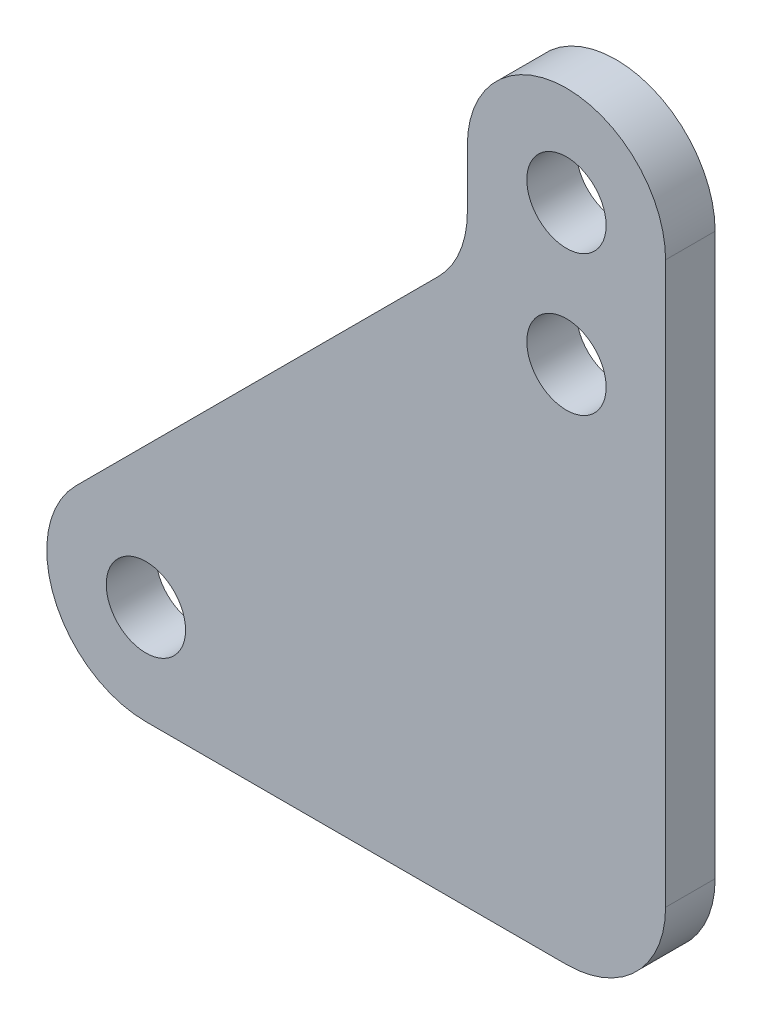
ISO-10303-21;
HEADER;
FILE_DESCRIPTION(('STEP AP214'),'2;1');
FILE_NAME('part.step','',(''),(''),'','','');
FILE_SCHEMA(('AUTOMOTIVE_DESIGN { 1 0 10303 214 1 1 1 1 }'));
ENDSEC;
DATA;
#1=APPLICATION_CONTEXT('core data for automotive mechanical design processes');
#2=APPLICATION_PROTOCOL_DEFINITION('international standard','automotive_design',2000,#1);
#3=PRODUCT_CONTEXT('',#1,'mechanical');
#4=PRODUCT('Part','Part','',(#3));
#5=PRODUCT_RELATED_PRODUCT_CATEGORY('part','',(#4));
#6=PRODUCT_DEFINITION_FORMATION('','',#4);
#7=PRODUCT_DEFINITION_CONTEXT('part definition',#1,'design');
#8=PRODUCT_DEFINITION('design','',#6,#7);
#9=PRODUCT_DEFINITION_SHAPE('','',#8);
#10=(LENGTH_UNIT() NAMED_UNIT(*) SI_UNIT(.MILLI.,.METRE.));
#11=(NAMED_UNIT(*) PLANE_ANGLE_UNIT() SI_UNIT($,.RADIAN.));
#12=(NAMED_UNIT(*) SI_UNIT($,.STERADIAN.) SOLID_ANGLE_UNIT());
#13=UNCERTAINTY_MEASURE_WITH_UNIT(LENGTH_MEASURE(1.E-05),#10,'distance_accuracy_value','');
#14=(GEOMETRIC_REPRESENTATION_CONTEXT(3) GLOBAL_UNCERTAINTY_ASSIGNED_CONTEXT((#13)) GLOBAL_UNIT_ASSIGNED_CONTEXT((#10,
#11,#12)) REPRESENTATION_CONTEXT('',''));
#15=CARTESIAN_POINT('',(0.,0.,0.));
#16=DIRECTION('',(0.,0.,1.));
#17=DIRECTION('',(1.,0.,0.));
#18=AXIS2_PLACEMENT_3D('',#15,#16,#17);
#19=CARTESIAN_POINT('',(133.137084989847,133.132813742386,10.));
#20=DIRECTION('',(0.,0.,1.));
#21=DIRECTION('',(1.,0.,0.));
#22=AXIS2_PLACEMENT_3D('',#19,#20,#21);
#23=PLANE('',#22);
#24=CARTESIAN_POINT('',(133.137084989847,104.852813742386,10.));
#25=DIRECTION('',(0.,0.,1.));
#26=DIRECTION('',(1.,0.,0.));
#27=AXIS2_PLACEMENT_3D('',#24,#25,#26);
#28=CIRCLE('',#27,8.00000000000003);
#29=CARTESIAN_POINT('',(141.137084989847,104.852813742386,10.));
#30=VERTEX_POINT('',#29);
#31=EDGE_CURVE('E217',#30,#30,#28,.T.);
#32=ORIENTED_EDGE('',*,*,#31,.F.);
#33=EDGE_LOOP('',(#32));
#34=FACE_BOUND('',#33,.T.);
#35=CARTESIAN_POINT('',(133.137084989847,133.132813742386,10.));
#36=DIRECTION('',(0.,0.,1.));
#37=DIRECTION('',(1.,0.,0.));
#38=AXIS2_PLACEMENT_3D('',#35,#36,#37);
#39=CIRCLE('',#38,20.0000000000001);
#40=CARTESIAN_POINT('',(153.137084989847,133.132813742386,10.));
#41=VERTEX_POINT('',#40);
#42=CARTESIAN_POINT('',(113.137084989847,133.132813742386,10.));
#43=VERTEX_POINT('',#42);
#44=EDGE_CURVE('E168',#41,#43,#39,.T.);
#45=ORIENTED_EDGE('',*,*,#44,.T.);
#46=DIRECTION('',(0.,-1.,0.));
#47=VECTOR('',#46,1.);
#48=CARTESIAN_POINT('',(113.137084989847,133.132813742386,10.));
#49=LINE('',#48,#47);
#50=CARTESIAN_POINT('',(113.137084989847,121.42135623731,10.));
#51=VERTEX_POINT('',#50);
#52=EDGE_CURVE('E104',#43,#51,#49,.T.);
#53=ORIENTED_EDGE('',*,*,#52,.T.);
#54=CARTESIAN_POINT('',(93.1370849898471,121.421356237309,10.));
#55=DIRECTION('',(0.,0.,-1.));
#56=DIRECTION('',(-1.,0.,0.));
#57=AXIS2_PLACEMENT_3D('',#54,#55,#56);
#58=CIRCLE('',#57,20.);
#59=CARTESIAN_POINT('',(107.279220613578,107.279220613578,10.));
#60=VERTEX_POINT('',#59);
#61=EDGE_CURVE('E189',#51,#60,#58,.T.);
#62=ORIENTED_EDGE('',*,*,#61,.T.);
#63=DIRECTION('',(-0.707106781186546,-0.707106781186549,0.));
#64=VECTOR('',#63,1.);
#65=CARTESIAN_POINT('',(34.1421356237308,34.1421356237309,10.));
#66=LINE('',#65,#64);
#67=CARTESIAN_POINT('',(34.1421356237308,34.1421356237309,10.));
#68=VERTEX_POINT('',#67);
#69=EDGE_CURVE('E203',#60,#68,#66,.T.);
#70=ORIENTED_EDGE('',*,*,#69,.T.);
#71=CARTESIAN_POINT('',(48.2842712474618,20.,10.));
#72=DIRECTION('',(0.,0.,1.));
#73=DIRECTION('',(1.,0.,0.));
#74=AXIS2_PLACEMENT_3D('',#71,#72,#73);
#75=CIRCLE('',#74,20.);
#76=CARTESIAN_POINT('',(48.2842712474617,0.,10.));
#77=VERTEX_POINT('',#76);
#78=EDGE_CURVE('E123',#68,#77,#75,.T.);
#79=ORIENTED_EDGE('',*,*,#78,.T.);
#80=DIRECTION('',(1.,0.,0.));
#81=VECTOR('',#80,1.);
#82=CARTESIAN_POINT('',(133.137084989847,0.,10.));
#83=LINE('',#82,#81);
#84=CARTESIAN_POINT('',(133.137084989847,0.,10.));
#85=VERTEX_POINT('',#84);
#86=EDGE_CURVE('E117',#77,#85,#83,.T.);
#87=ORIENTED_EDGE('',*,*,#86,.T.);
#88=CARTESIAN_POINT('',(133.137084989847,20.,10.));
#89=DIRECTION('',(0.,0.,1.));
#90=DIRECTION('',(1.,0.,0.));
#91=AXIS2_PLACEMENT_3D('',#88,#89,#90);
#92=CIRCLE('',#91,20.);
#93=CARTESIAN_POINT('',(153.137084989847,20.,10.));
#94=VERTEX_POINT('',#93);
#95=EDGE_CURVE('E121',#85,#94,#92,.T.);
#96=ORIENTED_EDGE('',*,*,#95,.T.);
#97=DIRECTION('',(0.,1.,0.));
#98=VECTOR('',#97,1.);
#99=CARTESIAN_POINT('',(153.137084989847,133.132813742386,10.));
#100=LINE('',#99,#98);
#101=EDGE_CURVE('E61',#94,#41,#100,.T.);
#102=ORIENTED_EDGE('',*,*,#101,.T.);
#103=EDGE_LOOP('',(#45,#53,#62,#70,#79,#87,#96,#102));
#104=FACE_BOUND('',#103,.T.);
#105=CARTESIAN_POINT('',(48.2842712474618,20.,10.));
#106=DIRECTION('',(0.,0.,1.));
#107=DIRECTION('',(1.,0.,0.));
#108=AXIS2_PLACEMENT_3D('',#105,#106,#107);
#109=CIRCLE('',#108,8.00000000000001);
#110=CARTESIAN_POINT('',(56.2842712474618,20.,10.));
#111=VERTEX_POINT('',#110);
#112=EDGE_CURVE('E150',#111,#111,#109,.T.);
#113=ORIENTED_EDGE('',*,*,#112,.F.);
#114=EDGE_LOOP('',(#113));
#115=FACE_BOUND('',#114,.T.);
#116=CARTESIAN_POINT('',(133.137084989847,133.132813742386,10.));
#117=DIRECTION('',(0.,0.,1.));
#118=DIRECTION('',(1.,0.,0.));
#119=AXIS2_PLACEMENT_3D('',#116,#117,#118);
#120=CIRCLE('',#119,8.00000000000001);
#121=CARTESIAN_POINT('',(141.137084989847,133.132813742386,10.));
#122=VERTEX_POINT('',#121);
#123=EDGE_CURVE('E225',#122,#122,#120,.T.);
#124=ORIENTED_EDGE('',*,*,#123,.F.);
#125=EDGE_LOOP('',(#124));
#126=FACE_BOUND('',#125,.T.);
#127=ADVANCED_FACE('F43',(#34,#104,#115,#126),#23,.T.);
#128=CARTESIAN_POINT('',(133.137084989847,133.132813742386,0.));
#129=DIRECTION('',(0.,0.,1.));
#130=DIRECTION('',(1.,0.,0.));
#131=AXIS2_PLACEMENT_3D('',#128,#129,#130);
#132=PLANE('',#131);
#133=CARTESIAN_POINT('',(133.137084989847,133.132813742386,0.));
#134=DIRECTION('',(0.,0.,1.));
#135=DIRECTION('',(1.,0.,0.));
#136=AXIS2_PLACEMENT_3D('',#133,#134,#135);
#137=CIRCLE('',#136,20.0000000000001);
#138=CARTESIAN_POINT('',(153.137084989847,133.132813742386,0.));
#139=VERTEX_POINT('',#138);
#140=CARTESIAN_POINT('',(113.137084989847,133.132813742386,0.));
#141=VERTEX_POINT('',#140);
#142=EDGE_CURVE('E145',#139,#141,#137,.T.);
#143=ORIENTED_EDGE('',*,*,#142,.F.);
#144=DIRECTION('',(0.,1.,0.));
#145=VECTOR('',#144,1.);
#146=CARTESIAN_POINT('',(153.137084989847,133.132813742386,0.));
#147=LINE('',#146,#145);
#148=CARTESIAN_POINT('',(153.137084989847,20.,0.));
#149=VERTEX_POINT('',#148);
#150=EDGE_CURVE('E96',#149,#139,#147,.T.);
#151=ORIENTED_EDGE('',*,*,#150,.F.);
#152=CARTESIAN_POINT('',(133.137084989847,20.,0.));
#153=DIRECTION('',(0.,0.,1.));
#154=DIRECTION('',(1.,0.,0.));
#155=AXIS2_PLACEMENT_3D('',#152,#153,#154);
#156=CIRCLE('',#155,20.);
#157=CARTESIAN_POINT('',(133.137084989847,0.,0.));
#158=VERTEX_POINT('',#157);
#159=EDGE_CURVE('E90',#158,#149,#156,.T.);
#160=ORIENTED_EDGE('',*,*,#159,.F.);
#161=DIRECTION('',(1.,0.,0.));
#162=VECTOR('',#161,1.);
#163=CARTESIAN_POINT('',(133.137084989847,0.,0.));
#164=LINE('',#163,#162);
#165=CARTESIAN_POINT('',(48.2842712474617,0.,0.));
#166=VERTEX_POINT('',#165);
#167=EDGE_CURVE('E132',#166,#158,#164,.T.);
#168=ORIENTED_EDGE('',*,*,#167,.F.);
#169=CARTESIAN_POINT('',(48.2842712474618,20.,0.));
#170=DIRECTION('',(0.,0.,1.));
#171=DIRECTION('',(1.,0.,0.));
#172=AXIS2_PLACEMENT_3D('',#169,#170,#171);
#173=CIRCLE('',#172,20.);
#174=CARTESIAN_POINT('',(34.1421356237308,34.1421356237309,0.));
#175=VERTEX_POINT('',#174);
#176=EDGE_CURVE('E159',#175,#166,#173,.T.);
#177=ORIENTED_EDGE('',*,*,#176,.F.);
#178=DIRECTION('',(-0.707106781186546,-0.707106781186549,0.));
#179=VECTOR('',#178,1.);
#180=CARTESIAN_POINT('',(34.1421356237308,34.1421356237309,0.));
#181=LINE('',#180,#179);
#182=CARTESIAN_POINT('',(107.279220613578,107.279220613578,0.));
#183=VERTEX_POINT('',#182);
#184=EDGE_CURVE('E156',#183,#175,#181,.T.);
#185=ORIENTED_EDGE('',*,*,#184,.F.);
#186=CARTESIAN_POINT('',(93.1370849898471,121.421356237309,0.));
#187=DIRECTION('',(0.,0.,-1.));
#188=DIRECTION('',(-1.,0.,0.));
#189=AXIS2_PLACEMENT_3D('',#186,#187,#188);
#190=CIRCLE('',#189,20.);
#191=CARTESIAN_POINT('',(113.137084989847,121.42135623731,0.));
#192=VERTEX_POINT('',#191);
#193=EDGE_CURVE('E153',#192,#183,#190,.T.);
#194=ORIENTED_EDGE('',*,*,#193,.F.);
#195=DIRECTION('',(0.,-1.,0.));
#196=VECTOR('',#195,1.);
#197=CARTESIAN_POINT('',(113.137084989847,133.132813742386,0.));
#198=LINE('',#197,#196);
#199=EDGE_CURVE('E149',#141,#192,#198,.T.);
#200=ORIENTED_EDGE('',*,*,#199,.F.);
#201=EDGE_LOOP('',(#143,#151,#160,#168,#177,#185,#194,#200));
#202=FACE_BOUND('',#201,.T.);
#203=CARTESIAN_POINT('',(48.2842712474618,20.,0.));
#204=DIRECTION('',(0.,0.,1.));
#205=DIRECTION('',(1.,0.,0.));
#206=AXIS2_PLACEMENT_3D('',#203,#204,#205);
#207=CIRCLE('',#206,8.00000000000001);
#208=CARTESIAN_POINT('',(56.2842712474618,20.,0.));
#209=VERTEX_POINT('',#208);
#210=EDGE_CURVE('E213',#209,#209,#207,.T.);
#211=ORIENTED_EDGE('',*,*,#210,.T.);
#212=EDGE_LOOP('',(#211));
#213=FACE_BOUND('',#212,.T.);
#214=CARTESIAN_POINT('',(133.137084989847,104.852813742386,0.));
#215=DIRECTION('',(0.,0.,1.));
#216=DIRECTION('',(1.,0.,0.));
#217=AXIS2_PLACEMENT_3D('',#214,#215,#216);
#218=CIRCLE('',#217,8.00000000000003);
#219=CARTESIAN_POINT('',(141.137084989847,104.852813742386,0.));
#220=VERTEX_POINT('',#219);
#221=EDGE_CURVE('E221',#220,#220,#218,.T.);
#222=ORIENTED_EDGE('',*,*,#221,.T.);
#223=EDGE_LOOP('',(#222));
#224=FACE_BOUND('',#223,.T.);
#225=CARTESIAN_POINT('',(133.137084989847,133.132813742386,0.));
#226=DIRECTION('',(0.,0.,1.));
#227=DIRECTION('',(1.,0.,0.));
#228=AXIS2_PLACEMENT_3D('',#225,#226,#227);
#229=CIRCLE('',#228,8.00000000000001);
#230=CARTESIAN_POINT('',(141.137084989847,133.132813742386,0.));
#231=VERTEX_POINT('',#230);
#232=EDGE_CURVE('E229',#231,#231,#229,.T.);
#233=ORIENTED_EDGE('',*,*,#232,.T.);
#234=EDGE_LOOP('',(#233));
#235=FACE_BOUND('',#234,.T.);
#236=ADVANCED_FACE('F193',(#202,#213,#224,#235),#132,.F.);
#237=CARTESIAN_POINT('',(133.137084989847,133.132813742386,10.));
#238=DIRECTION('',(0.,0.,-1.));
#239=DIRECTION('',(-1.,0.,0.));
#240=AXIS2_PLACEMENT_3D('',#237,#238,#239);
#241=CYLINDRICAL_SURFACE('',#240,20.0000000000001);
#242=ORIENTED_EDGE('',*,*,#142,.T.);
#243=DIRECTION('',(0.,0.,-1.));
#244=VECTOR('',#243,1.);
#245=CARTESIAN_POINT('',(113.137084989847,133.132813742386,10.));
#246=LINE('',#245,#244);
#247=EDGE_CURVE('E11',#43,#141,#246,.T.);
#248=ORIENTED_EDGE('',*,*,#247,.F.);
#249=ORIENTED_EDGE('',*,*,#44,.F.);
#250=DIRECTION('',(0.,0.,-1.));
#251=VECTOR('',#250,1.);
#252=CARTESIAN_POINT('',(153.137084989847,133.132813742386,10.));
#253=LINE('',#252,#251);
#254=EDGE_CURVE('E141',#41,#139,#253,.T.);
#255=ORIENTED_EDGE('',*,*,#254,.T.);
#256=EDGE_LOOP('',(#242,#248,#249,#255));
#257=FACE_BOUND('',#256,.T.);
#258=ADVANCED_FACE('F45',(#257),#241,.T.);
#259=CARTESIAN_POINT('',(113.137084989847,133.132813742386,10.));
#260=DIRECTION('',(1.,0.,0.));
#261=DIRECTION('',(0.,0.,-1.));
#262=AXIS2_PLACEMENT_3D('',#259,#260,#261);
#263=PLANE('',#262);
#264=ORIENTED_EDGE('',*,*,#199,.T.);
#265=DIRECTION('',(0.,0.,-1.));
#266=VECTOR('',#265,1.);
#267=CARTESIAN_POINT('',(113.137084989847,121.42135623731,10.));
#268=LINE('',#267,#266);
#269=EDGE_CURVE('E53',#51,#192,#268,.T.);
#270=ORIENTED_EDGE('',*,*,#269,.F.);
#271=ORIENTED_EDGE('',*,*,#52,.F.);
#272=ORIENTED_EDGE('',*,*,#247,.T.);
#273=EDGE_LOOP('',(#264,#270,#271,#272));
#274=FACE_BOUND('',#273,.T.);
#275=ADVANCED_FACE('F264',(#274),#263,.F.);
#276=CARTESIAN_POINT('',(93.1370849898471,121.421356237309,10.));
#277=DIRECTION('',(0.,0.,-1.));
#278=DIRECTION('',(-1.,0.,0.));
#279=AXIS2_PLACEMENT_3D('',#276,#277,#278);
#280=CYLINDRICAL_SURFACE('',#279,20.);
#281=ORIENTED_EDGE('',*,*,#193,.T.);
#282=DIRECTION('',(0.,0.,-1.));
#283=VECTOR('',#282,1.);
#284=CARTESIAN_POINT('',(107.279220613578,107.279220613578,10.));
#285=LINE('',#284,#283);
#286=EDGE_CURVE('E179',#60,#183,#285,.T.);
#287=ORIENTED_EDGE('',*,*,#286,.F.);
#288=ORIENTED_EDGE('',*,*,#61,.F.);
#289=ORIENTED_EDGE('',*,*,#269,.T.);
#290=EDGE_LOOP('',(#281,#287,#288,#289));
#291=FACE_BOUND('',#290,.T.);
#292=ADVANCED_FACE('F187',(#291),#280,.F.);
#293=CARTESIAN_POINT('',(34.1421356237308,34.1421356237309,10.));
#294=DIRECTION('',(0.707106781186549,-0.707106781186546,0.));
#295=DIRECTION('',(0.707106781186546,0.707106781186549,0.));
#296=AXIS2_PLACEMENT_3D('',#293,#294,#295);
#297=PLANE('',#296);
#298=ORIENTED_EDGE('',*,*,#184,.T.);
#299=DIRECTION('',(0.,0.,-1.));
#300=VECTOR('',#299,1.);
#301=CARTESIAN_POINT('',(34.1421356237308,34.1421356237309,10.));
#302=LINE('',#301,#300);
#303=EDGE_CURVE('E175',#68,#175,#302,.T.);
#304=ORIENTED_EDGE('',*,*,#303,.F.);
#305=ORIENTED_EDGE('',*,*,#69,.F.);
#306=ORIENTED_EDGE('',*,*,#286,.T.);
#307=EDGE_LOOP('',(#298,#304,#305,#306));
#308=FACE_BOUND('',#307,.T.);
#309=ADVANCED_FACE('F198',(#308),#297,.F.);
#310=CARTESIAN_POINT('',(48.2842712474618,20.,10.));
#311=DIRECTION('',(0.,0.,-1.));
#312=DIRECTION('',(-1.,0.,0.));
#313=AXIS2_PLACEMENT_3D('',#310,#311,#312);
#314=CYLINDRICAL_SURFACE('',#313,20.);
#315=ORIENTED_EDGE('',*,*,#176,.T.);
#316=DIRECTION('',(0.,0.,-1.));
#317=VECTOR('',#316,1.);
#318=CARTESIAN_POINT('',(48.2842712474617,0.,10.));
#319=LINE('',#318,#317);
#320=EDGE_CURVE('E134',#77,#166,#319,.T.);
#321=ORIENTED_EDGE('',*,*,#320,.F.);
#322=ORIENTED_EDGE('',*,*,#78,.F.);
#323=ORIENTED_EDGE('',*,*,#303,.T.);
#324=EDGE_LOOP('',(#315,#321,#322,#323));
#325=FACE_BOUND('',#324,.T.);
#326=ADVANCED_FACE('F201',(#325),#314,.T.);
#327=CARTESIAN_POINT('',(133.137084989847,0.,10.));
#328=DIRECTION('',(0.,1.,0.));
#329=DIRECTION('',(-1.,0.,0.));
#330=AXIS2_PLACEMENT_3D('',#327,#328,#329);
#331=PLANE('',#330);
#332=ORIENTED_EDGE('',*,*,#167,.T.);
#333=DIRECTION('',(0.,0.,-1.));
#334=VECTOR('',#333,1.);
#335=CARTESIAN_POINT('',(133.137084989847,0.,10.));
#336=LINE('',#335,#334);
#337=EDGE_CURVE('E129',#85,#158,#336,.T.);
#338=ORIENTED_EDGE('',*,*,#337,.F.);
#339=ORIENTED_EDGE('',*,*,#86,.F.);
#340=ORIENTED_EDGE('',*,*,#320,.T.);
#341=EDGE_LOOP('',(#332,#338,#339,#340));
#342=FACE_BOUND('',#341,.T.);
#343=ADVANCED_FACE('F130',(#342),#331,.F.);
#344=CARTESIAN_POINT('',(133.137084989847,20.,10.));
#345=DIRECTION('',(0.,0.,-1.));
#346=DIRECTION('',(-1.,0.,0.));
#347=AXIS2_PLACEMENT_3D('',#344,#345,#346);
#348=CYLINDRICAL_SURFACE('',#347,20.);
#349=ORIENTED_EDGE('',*,*,#159,.T.);
#350=DIRECTION('',(0.,0.,-1.));
#351=VECTOR('',#350,1.);
#352=CARTESIAN_POINT('',(153.137084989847,20.,10.));
#353=LINE('',#352,#351);
#354=EDGE_CURVE('E135',#94,#149,#353,.T.);
#355=ORIENTED_EDGE('',*,*,#354,.F.);
#356=ORIENTED_EDGE('',*,*,#95,.F.);
#357=ORIENTED_EDGE('',*,*,#337,.T.);
#358=EDGE_LOOP('',(#349,#355,#356,#357));
#359=FACE_BOUND('',#358,.T.);
#360=ADVANCED_FACE('F137',(#359),#348,.T.);
#361=CARTESIAN_POINT('',(153.137084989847,133.132813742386,10.));
#362=DIRECTION('',(-1.,0.,0.));
#363=DIRECTION('',(0.,-1.,0.));
#364=AXIS2_PLACEMENT_3D('',#361,#362,#363);
#365=PLANE('',#364);
#366=ORIENTED_EDGE('',*,*,#150,.T.);
#367=ORIENTED_EDGE('',*,*,#254,.F.);
#368=ORIENTED_EDGE('',*,*,#101,.F.);
#369=ORIENTED_EDGE('',*,*,#354,.T.);
#370=EDGE_LOOP('',(#366,#367,#368,#369));
#371=FACE_BOUND('',#370,.T.);
#372=ADVANCED_FACE('F252',(#371),#365,.F.);
#373=CARTESIAN_POINT('',(48.2842712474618,20.,10.));
#374=DIRECTION('',(0.,0.,-1.));
#375=DIRECTION('',(-1.,0.,0.));
#376=AXIS2_PLACEMENT_3D('',#373,#374,#375);
#377=CYLINDRICAL_SURFACE('',#376,8.00000000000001);
#378=ORIENTED_EDGE('',*,*,#112,.T.);
#379=EDGE_LOOP('',(#378));
#380=FACE_BOUND('',#379,.T.);
#381=ORIENTED_EDGE('',*,*,#210,.F.);
#382=EDGE_LOOP('',(#381));
#383=FACE_BOUND('',#382,.T.);
#384=ADVANCED_FACE('F249',(#380,#383),#377,.F.);
#385=CARTESIAN_POINT('',(133.137084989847,104.852813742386,10.));
#386=DIRECTION('',(0.,0.,-1.));
#387=DIRECTION('',(-1.,0.,0.));
#388=AXIS2_PLACEMENT_3D('',#385,#386,#387);
#389=CYLINDRICAL_SURFACE('',#388,8.00000000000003);
#390=ORIENTED_EDGE('',*,*,#31,.T.);
#391=EDGE_LOOP('',(#390));
#392=FACE_BOUND('',#391,.T.);
#393=ORIENTED_EDGE('',*,*,#221,.F.);
#394=EDGE_LOOP('',(#393));
#395=FACE_BOUND('',#394,.T.);
#396=ADVANCED_FACE('F328',(#392,#395),#389,.F.);
#397=CARTESIAN_POINT('',(133.137084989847,133.132813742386,10.));
#398=DIRECTION('',(0.,0.,-1.));
#399=DIRECTION('',(-1.,0.,0.));
#400=AXIS2_PLACEMENT_3D('',#397,#398,#399);
#401=CYLINDRICAL_SURFACE('',#400,8.00000000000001);
#402=ORIENTED_EDGE('',*,*,#123,.T.);
#403=EDGE_LOOP('',(#402));
#404=FACE_BOUND('',#403,.T.);
#405=ORIENTED_EDGE('',*,*,#232,.F.);
#406=EDGE_LOOP('',(#405));
#407=FACE_BOUND('',#406,.T.);
#408=ADVANCED_FACE('F237',(#404,#407),#401,.F.);
#409=CLOSED_SHELL('',(#127,#236,#258,#275,#292,#309,#326,#343,#360,#372,#384,#396,#408));
#410=MANIFOLD_SOLID_BREP('B2',#409);
#411=ADVANCED_BREP_SHAPE_REPRESENTATION('',(#18,#410),#14);
#412=SHAPE_DEFINITION_REPRESENTATION(#9,#411);
ENDSEC;
END-ISO-10303-21;
